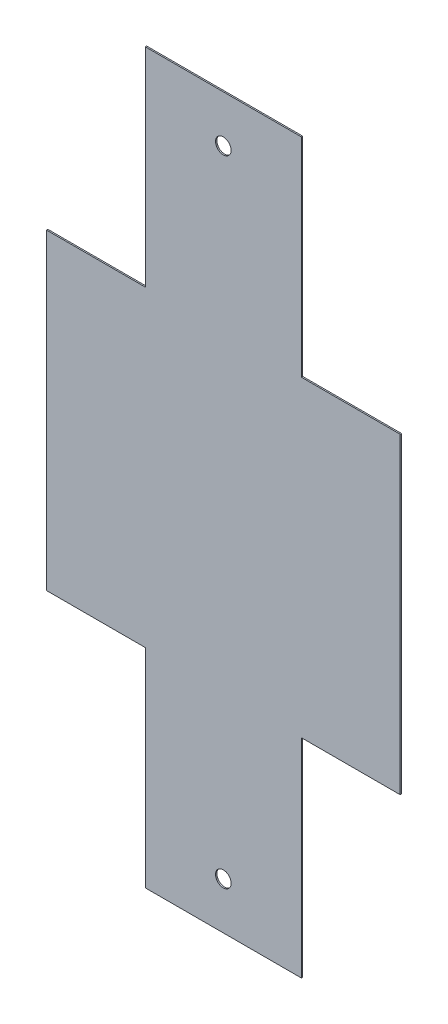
from build123d import *

# Parameters (mm, degrees)
SKETCH_1_W          = 76
SKETCH_1_H          = 70
EXTRUDE_1_DEPTH     = 0.13
CUT_EXTRUDE_1_DEPTH = 52.662528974
CUT_EXTRUDE_2_REACH = 40.91
SKETCH_3_R          = 0.75


with BuildPart() as part:
    # Sketch 1 → Extrude 1 (new body)
    with BuildSketch(Plane.XY):
        Rectangle(SKETCH_1_W, SKETCH_1_H)
    extrude(amount=EXTRUDE_1_DEPTH)

    # Sketch 2 → Cut-Extrude 1 (cut, through all)
    with BuildSketch(Plane.XY.offset(0.13)):
        Polygon((-38, 35), (-7.5, 35), (-7.5, 15), (-17, 15), (-17, -15), (-7.5, -15), (-7.5, -35), (-38, -35), align=None)
        Polygon((17, 15), (7.5, 15), (7.5, 35), (38, 35), (38, -35), (7.5, -35), (7.5, -15), (17, -15), align=None)
    extrude(amount=-CUT_EXTRUDE_1_DEPTH, mode=Mode.SUBTRACT)

    # Sketch 3 → Cut-Extrude 2 (cut, up to next)
    with BuildSketch(Plane.XY.offset(0.13), mode=Mode.PRIVATE) as cut_extrude_2_sk1:
        with Locations((0, 30.5)):
            Circle(SKETCH_3_R)
    cut_extrude_2_tool1 = extrude(cut_extrude_2_sk1.sketch, amount=-CUT_EXTRUDE_2_REACH, mode=Mode.PRIVATE) & part.part
    # Sketch 3 → Cut-Extrude 2 (cut, up to next)
    with BuildSketch(Plane.XY.offset(0.13), mode=Mode.PRIVATE) as cut_extrude_2_sk2:
        with Locations((0, -30.5)):
            Circle(SKETCH_3_R)
    cut_extrude_2_tool2 = extrude(cut_extrude_2_sk2.sketch, amount=-CUT_EXTRUDE_2_REACH, mode=Mode.PRIVATE) & part.part
    add(cut_extrude_2_tool1.solids().sort_by_distance((0, 30.5, 0.13))[0], mode=Mode.SUBTRACT)
    add(cut_extrude_2_tool2.solids().sort_by_distance((0, -30.5, 0.13))[0], mode=Mode.SUBTRACT)


solid = part.part
